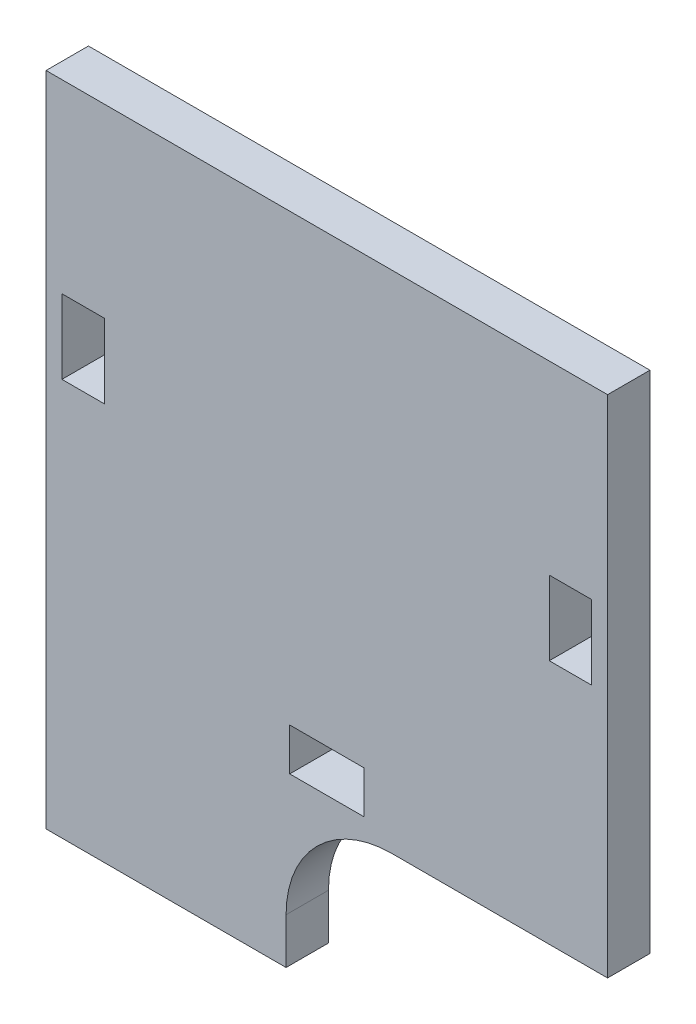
ISO-10303-21;
HEADER;
FILE_DESCRIPTION(('STEP AP214'),'2;1');
FILE_NAME('part.step','',(''),(''),'','','');
FILE_SCHEMA(('AUTOMOTIVE_DESIGN { 1 0 10303 214 1 1 1 1 }'));
ENDSEC;
DATA;
#1=APPLICATION_CONTEXT('core data for automotive mechanical design processes');
#2=APPLICATION_PROTOCOL_DEFINITION('international standard','automotive_design',2000,#1);
#3=PRODUCT_CONTEXT('',#1,'mechanical');
#4=PRODUCT('Part','Part','',(#3));
#5=PRODUCT_RELATED_PRODUCT_CATEGORY('part','',(#4));
#6=PRODUCT_DEFINITION_FORMATION('','',#4);
#7=PRODUCT_DEFINITION_CONTEXT('part definition',#1,'design');
#8=PRODUCT_DEFINITION('design','',#6,#7);
#9=PRODUCT_DEFINITION_SHAPE('','',#8);
#10=(LENGTH_UNIT() NAMED_UNIT(*) SI_UNIT(.MILLI.,.METRE.));
#11=(NAMED_UNIT(*) PLANE_ANGLE_UNIT() SI_UNIT($,.RADIAN.));
#12=(NAMED_UNIT(*) SI_UNIT($,.STERADIAN.) SOLID_ANGLE_UNIT());
#13=UNCERTAINTY_MEASURE_WITH_UNIT(LENGTH_MEASURE(1.E-05),#10,'distance_accuracy_value','');
#14=(GEOMETRIC_REPRESENTATION_CONTEXT(3) GLOBAL_UNCERTAINTY_ASSIGNED_CONTEXT((#13)) GLOBAL_UNIT_ASSIGNED_CONTEXT((#10,
#11,#12)) REPRESENTATION_CONTEXT('',''));
#15=CARTESIAN_POINT('',(0.,0.,0.));
#16=DIRECTION('',(0.,0.,1.));
#17=DIRECTION('',(1.,0.,0.));
#18=AXIS2_PLACEMENT_3D('',#15,#16,#17);
#19=CARTESIAN_POINT('',(22.4511137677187,0.,4.));
#20=DIRECTION('',(1.,0.,0.));
#21=DIRECTION('',(0.,1.,0.));
#22=AXIS2_PLACEMENT_3D('',#19,#20,#21);
#23=PLANE('',#22);
#24=DIRECTION('',(0.,0.,1.));
#25=VECTOR('',#24,1.);
#26=CARTESIAN_POINT('',(22.4511137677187,-41.0482536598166,4.));
#27=LINE('',#26,#25);
#28=CARTESIAN_POINT('',(22.4511137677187,-41.0482536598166,0.));
#29=VERTEX_POINT('',#28);
#30=CARTESIAN_POINT('',(22.4511137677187,-41.0482536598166,4.));
#31=VERTEX_POINT('',#30);
#32=EDGE_CURVE('E163',#29,#31,#27,.T.);
#33=ORIENTED_EDGE('',*,*,#32,.F.);
#34=DIRECTION('',(0.,-1.,0.));
#35=VECTOR('',#34,1.);
#36=CARTESIAN_POINT('',(22.4511137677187,0.,0.));
#37=LINE('',#36,#35);
#38=CARTESIAN_POINT('',(22.4511137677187,6.63529391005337,0.));
#39=VERTEX_POINT('',#38);
#40=EDGE_CURVE('E234',#39,#29,#37,.T.);
#41=ORIENTED_EDGE('',*,*,#40,.F.);
#42=DIRECTION('',(0.,0.,-1.));
#43=VECTOR('',#42,1.);
#44=CARTESIAN_POINT('',(22.4511137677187,6.63529391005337,4.));
#45=LINE('',#44,#43);
#46=CARTESIAN_POINT('',(22.4511137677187,6.63529391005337,4.));
#47=VERTEX_POINT('',#46);
#48=EDGE_CURVE('E181',#47,#39,#45,.T.);
#49=ORIENTED_EDGE('',*,*,#48,.F.);
#50=DIRECTION('',(0.,-1.,0.));
#51=VECTOR('',#50,1.);
#52=CARTESIAN_POINT('',(22.4511137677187,0.,4.));
#53=LINE('',#52,#51);
#54=EDGE_CURVE('E177',#47,#31,#53,.T.);
#55=ORIENTED_EDGE('',*,*,#54,.T.);
#56=EDGE_LOOP('',(#33,#41,#49,#55));
#57=FACE_BOUND('',#56,.T.);
#58=ADVANCED_FACE('F35',(#57),#23,.T.);
#59=CARTESIAN_POINT('',(0.,6.63529391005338,4.));
#60=DIRECTION('',(0.,1.,0.));
#61=DIRECTION('',(-1.,0.,0.));
#62=AXIS2_PLACEMENT_3D('',#59,#60,#61);
#63=PLANE('',#62);
#64=DIRECTION('',(1.,0.,0.));
#65=VECTOR('',#64,1.);
#66=CARTESIAN_POINT('',(0.,6.63529391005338,0.));
#67=LINE('',#66,#65);
#68=CARTESIAN_POINT('',(-30.5488862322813,6.63529391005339,0.));
#69=VERTEX_POINT('',#68);
#70=EDGE_CURVE('E236',#69,#39,#67,.T.);
#71=ORIENTED_EDGE('',*,*,#70,.F.);
#72=DIRECTION('',(0.,0.,-1.));
#73=VECTOR('',#72,1.);
#74=CARTESIAN_POINT('',(-30.5488862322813,6.63529391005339,4.));
#75=LINE('',#74,#73);
#76=CARTESIAN_POINT('',(-30.5488862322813,6.63529391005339,4.));
#77=VERTEX_POINT('',#76);
#78=EDGE_CURVE('E249',#77,#69,#75,.T.);
#79=ORIENTED_EDGE('',*,*,#78,.F.);
#80=DIRECTION('',(1.,0.,0.));
#81=VECTOR('',#80,1.);
#82=CARTESIAN_POINT('',(0.,6.63529391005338,4.));
#83=LINE('',#82,#81);
#84=EDGE_CURVE('E182',#77,#47,#83,.T.);
#85=ORIENTED_EDGE('',*,*,#84,.T.);
#86=ORIENTED_EDGE('',*,*,#48,.T.);
#87=EDGE_LOOP('',(#71,#79,#85,#86));
#88=FACE_BOUND('',#87,.T.);
#89=ADVANCED_FACE('F350',(#88),#63,.T.);
#90=CARTESIAN_POINT('',(-30.5488862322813,0.,4.));
#91=DIRECTION('',(1.,0.,0.));
#92=DIRECTION('',(0.,1.,0.));
#93=AXIS2_PLACEMENT_3D('',#90,#91,#92);
#94=PLANE('',#93);
#95=DIRECTION('',(0.,-1.,0.));
#96=VECTOR('',#95,1.);
#97=CARTESIAN_POINT('',(-30.5488862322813,0.,0.));
#98=LINE('',#97,#96);
#99=CARTESIAN_POINT('',(-30.5488862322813,-55.3647060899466,0.));
#100=VERTEX_POINT('',#99);
#101=EDGE_CURVE('E239',#69,#100,#98,.T.);
#102=ORIENTED_EDGE('',*,*,#101,.T.);
#103=DIRECTION('',(0.,0.,-1.));
#104=VECTOR('',#103,1.);
#105=CARTESIAN_POINT('',(-30.5488862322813,-55.3647060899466,4.));
#106=LINE('',#105,#104);
#107=CARTESIAN_POINT('',(-30.5488862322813,-55.3647060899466,4.));
#108=VERTEX_POINT('',#107);
#109=EDGE_CURVE('E246',#108,#100,#106,.T.);
#110=ORIENTED_EDGE('',*,*,#109,.F.);
#111=DIRECTION('',(0.,-1.,0.));
#112=VECTOR('',#111,1.);
#113=CARTESIAN_POINT('',(-30.5488862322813,0.,4.));
#114=LINE('',#113,#112);
#115=EDGE_CURVE('E185',#77,#108,#114,.T.);
#116=ORIENTED_EDGE('',*,*,#115,.F.);
#117=ORIENTED_EDGE('',*,*,#78,.T.);
#118=EDGE_LOOP('',(#102,#110,#116,#117));
#119=FACE_BOUND('',#118,.T.);
#120=ADVANCED_FACE('F355',(#119),#94,.F.);
#121=CARTESIAN_POINT('',(0.,-55.3647060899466,4.));
#122=DIRECTION('',(0.,1.,0.));
#123=DIRECTION('',(0.,0.,1.));
#124=AXIS2_PLACEMENT_3D('',#121,#122,#123);
#125=PLANE('',#124);
#126=DIRECTION('',(1.,0.,0.));
#127=VECTOR('',#126,1.);
#128=CARTESIAN_POINT('',(0.,-55.3647060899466,0.));
#129=LINE('',#128,#127);
#130=CARTESIAN_POINT('',(-7.89370636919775,-55.3647060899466,0.));
#131=VERTEX_POINT('',#130);
#132=EDGE_CURVE('E242',#100,#131,#129,.T.);
#133=ORIENTED_EDGE('',*,*,#132,.T.);
#134=DIRECTION('',(0.,0.,1.));
#135=VECTOR('',#134,1.);
#136=CARTESIAN_POINT('',(-7.89370636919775,-55.3647060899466,4.));
#137=LINE('',#136,#135);
#138=CARTESIAN_POINT('',(-7.89370636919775,-55.3647060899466,4.));
#139=VERTEX_POINT('',#138);
#140=EDGE_CURVE('E171',#131,#139,#137,.T.);
#141=ORIENTED_EDGE('',*,*,#140,.T.);
#142=DIRECTION('',(1.,0.,0.));
#143=VECTOR('',#142,1.);
#144=CARTESIAN_POINT('',(0.,-55.3647060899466,4.));
#145=LINE('',#144,#143);
#146=EDGE_CURVE('E194',#108,#139,#145,.T.);
#147=ORIENTED_EDGE('',*,*,#146,.F.);
#148=ORIENTED_EDGE('',*,*,#109,.T.);
#149=EDGE_LOOP('',(#133,#141,#147,#148));
#150=FACE_BOUND('',#149,.T.);
#151=ADVANCED_FACE('F371',(#150),#125,.F.);
#152=CARTESIAN_POINT('',(0.,-35.3647060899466,4.));
#153=DIRECTION('',(0.,1.,0.));
#154=DIRECTION('',(0.,0.,1.));
#155=AXIS2_PLACEMENT_3D('',#152,#153,#154);
#156=PLANE('',#155);
#157=DIRECTION('',(1.,0.,0.));
#158=VECTOR('',#157,1.);
#159=CARTESIAN_POINT('',(0.,-35.3647060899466,0.));
#160=LINE('',#159,#158);
#161=CARTESIAN_POINT('',(-7.54888623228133,-35.3647060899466,0.));
#162=VERTEX_POINT('',#161);
#163=CARTESIAN_POINT('',(-0.548886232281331,-35.3647060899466,0.));
#164=VERTEX_POINT('',#163);
#165=EDGE_CURVE('E222',#162,#164,#160,.T.);
#166=ORIENTED_EDGE('',*,*,#165,.T.);
#167=DIRECTION('',(0.,0.,-1.));
#168=VECTOR('',#167,1.);
#169=CARTESIAN_POINT('',(-0.548886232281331,-35.3647060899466,4.));
#170=LINE('',#169,#168);
#171=CARTESIAN_POINT('',(-0.548886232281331,-35.3647060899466,4.));
#172=VERTEX_POINT('',#171);
#173=EDGE_CURVE('E250',#172,#164,#170,.T.);
#174=ORIENTED_EDGE('',*,*,#173,.F.);
#175=DIRECTION('',(1.,0.,0.));
#176=VECTOR('',#175,1.);
#177=CARTESIAN_POINT('',(0.,-35.3647060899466,4.));
#178=LINE('',#177,#176);
#179=CARTESIAN_POINT('',(-7.54888623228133,-35.3647060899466,4.));
#180=VERTEX_POINT('',#179);
#181=EDGE_CURVE('E316',#180,#172,#178,.T.);
#182=ORIENTED_EDGE('',*,*,#181,.F.);
#183=DIRECTION('',(0.,0.,-1.));
#184=VECTOR('',#183,1.);
#185=CARTESIAN_POINT('',(-7.54888623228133,-35.3647060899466,4.));
#186=LINE('',#185,#184);
#187=EDGE_CURVE('E253',#180,#162,#186,.T.);
#188=ORIENTED_EDGE('',*,*,#187,.T.);
#189=EDGE_LOOP('',(#166,#174,#182,#188));
#190=FACE_BOUND('',#189,.T.);
#191=ADVANCED_FACE('F335',(#190),#156,.F.);
#192=CARTESIAN_POINT('',(-0.548886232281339,0.,4.));
#193=DIRECTION('',(1.,0.,0.));
#194=DIRECTION('',(0.,1.,0.));
#195=AXIS2_PLACEMENT_3D('',#192,#193,#194);
#196=PLANE('',#195);
#197=DIRECTION('',(0.,-1.,0.));
#198=VECTOR('',#197,1.);
#199=CARTESIAN_POINT('',(-0.548886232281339,0.,0.));
#200=LINE('',#199,#198);
#201=CARTESIAN_POINT('',(-0.548886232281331,-39.3647060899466,0.));
#202=VERTEX_POINT('',#201);
#203=EDGE_CURVE('E225',#164,#202,#200,.T.);
#204=ORIENTED_EDGE('',*,*,#203,.T.);
#205=DIRECTION('',(0.,0.,-1.));
#206=VECTOR('',#205,1.);
#207=CARTESIAN_POINT('',(-0.548886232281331,-39.3647060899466,4.));
#208=LINE('',#207,#206);
#209=CARTESIAN_POINT('',(-0.548886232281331,-39.3647060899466,4.));
#210=VERTEX_POINT('',#209);
#211=EDGE_CURVE('E258',#210,#202,#208,.T.);
#212=ORIENTED_EDGE('',*,*,#211,.F.);
#213=DIRECTION('',(0.,-1.,0.));
#214=VECTOR('',#213,1.);
#215=CARTESIAN_POINT('',(-0.548886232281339,0.,4.));
#216=LINE('',#215,#214);
#217=EDGE_CURVE('E319',#172,#210,#216,.T.);
#218=ORIENTED_EDGE('',*,*,#217,.F.);
#219=ORIENTED_EDGE('',*,*,#173,.T.);
#220=EDGE_LOOP('',(#204,#212,#218,#219));
#221=FACE_BOUND('',#220,.T.);
#222=ADVANCED_FACE('F337',(#221),#196,.F.);
#223=CARTESIAN_POINT('',(0.,-39.3647060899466,4.));
#224=DIRECTION('',(0.,1.,0.));
#225=DIRECTION('',(0.,0.,1.));
#226=AXIS2_PLACEMENT_3D('',#223,#224,#225);
#227=PLANE('',#226);
#228=DIRECTION('',(1.,0.,0.));
#229=VECTOR('',#228,1.);
#230=CARTESIAN_POINT('',(0.,-39.3647060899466,0.));
#231=LINE('',#230,#229);
#232=CARTESIAN_POINT('',(-7.54888623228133,-39.3647060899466,0.));
#233=VERTEX_POINT('',#232);
#234=EDGE_CURVE('E228',#233,#202,#231,.T.);
#235=ORIENTED_EDGE('',*,*,#234,.F.);
#236=DIRECTION('',(0.,0.,-1.));
#237=VECTOR('',#236,1.);
#238=CARTESIAN_POINT('',(-7.54888623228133,-39.3647060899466,4.));
#239=LINE('',#238,#237);
#240=CARTESIAN_POINT('',(-7.54888623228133,-39.3647060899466,4.));
#241=VERTEX_POINT('',#240);
#242=EDGE_CURVE('E255',#241,#233,#239,.T.);
#243=ORIENTED_EDGE('',*,*,#242,.F.);
#244=DIRECTION('',(1.,0.,0.));
#245=VECTOR('',#244,1.);
#246=CARTESIAN_POINT('',(0.,-39.3647060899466,4.));
#247=LINE('',#246,#245);
#248=EDGE_CURVE('E188',#241,#210,#247,.T.);
#249=ORIENTED_EDGE('',*,*,#248,.T.);
#250=ORIENTED_EDGE('',*,*,#211,.T.);
#251=EDGE_LOOP('',(#235,#243,#249,#250));
#252=FACE_BOUND('',#251,.T.);
#253=ADVANCED_FACE('F324',(#252),#227,.T.);
#254=CARTESIAN_POINT('',(0.,-10.8647060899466,4.));
#255=DIRECTION('',(0.,1.,0.));
#256=DIRECTION('',(0.,0.,1.));
#257=AXIS2_PLACEMENT_3D('',#254,#255,#256);
#258=PLANE('',#257);
#259=DIRECTION('',(1.,0.,0.));
#260=VECTOR('',#259,1.);
#261=CARTESIAN_POINT('',(0.,-10.8647060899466,0.));
#262=LINE('',#261,#260);
#263=CARTESIAN_POINT('',(-29.0488862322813,-10.8647060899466,0.));
#264=VERTEX_POINT('',#263);
#265=CARTESIAN_POINT('',(-25.0488862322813,-10.8647060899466,0.));
#266=VERTEX_POINT('',#265);
#267=EDGE_CURVE('E210',#264,#266,#262,.T.);
#268=ORIENTED_EDGE('',*,*,#267,.T.);
#269=DIRECTION('',(0.,0.,-1.));
#270=VECTOR('',#269,1.);
#271=CARTESIAN_POINT('',(-25.0488862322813,-10.8647060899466,4.));
#272=LINE('',#271,#270);
#273=CARTESIAN_POINT('',(-25.0488862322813,-10.8647060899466,4.));
#274=VERTEX_POINT('',#273);
#275=EDGE_CURVE('E256',#274,#266,#272,.T.);
#276=ORIENTED_EDGE('',*,*,#275,.F.);
#277=DIRECTION('',(1.,0.,0.));
#278=VECTOR('',#277,1.);
#279=CARTESIAN_POINT('',(0.,-10.8647060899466,4.));
#280=LINE('',#279,#278);
#281=CARTESIAN_POINT('',(-29.0488862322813,-10.8647060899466,4.));
#282=VERTEX_POINT('',#281);
#283=EDGE_CURVE('E305',#282,#274,#280,.T.);
#284=ORIENTED_EDGE('',*,*,#283,.F.);
#285=DIRECTION('',(0.,0.,-1.));
#286=VECTOR('',#285,1.);
#287=CARTESIAN_POINT('',(-29.0488862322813,-10.8647060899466,4.));
#288=LINE('',#287,#286);
#289=EDGE_CURVE('E262',#282,#264,#288,.T.);
#290=ORIENTED_EDGE('',*,*,#289,.T.);
#291=EDGE_LOOP('',(#268,#276,#284,#290));
#292=FACE_BOUND('',#291,.T.);
#293=ADVANCED_FACE('F366',(#292),#258,.F.);
#294=CARTESIAN_POINT('',(-25.0488862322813,0.,4.));
#295=DIRECTION('',(1.,0.,0.));
#296=DIRECTION('',(0.,0.,-1.));
#297=AXIS2_PLACEMENT_3D('',#294,#295,#296);
#298=PLANE('',#297);
#299=DIRECTION('',(0.,-1.,0.));
#300=VECTOR('',#299,1.);
#301=CARTESIAN_POINT('',(-25.0488862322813,0.,0.));
#302=LINE('',#301,#300);
#303=CARTESIAN_POINT('',(-25.0488862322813,-17.8647060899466,0.));
#304=VERTEX_POINT('',#303);
#305=EDGE_CURVE('E213',#266,#304,#302,.T.);
#306=ORIENTED_EDGE('',*,*,#305,.T.);
#307=DIRECTION('',(0.,0.,-1.));
#308=VECTOR('',#307,1.);
#309=CARTESIAN_POINT('',(-25.0488862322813,-17.8647060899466,4.));
#310=LINE('',#309,#308);
#311=CARTESIAN_POINT('',(-25.0488862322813,-17.8647060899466,4.));
#312=VERTEX_POINT('',#311);
#313=EDGE_CURVE('E267',#312,#304,#310,.T.);
#314=ORIENTED_EDGE('',*,*,#313,.F.);
#315=DIRECTION('',(0.,-1.,0.));
#316=VECTOR('',#315,1.);
#317=CARTESIAN_POINT('',(-25.0488862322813,0.,4.));
#318=LINE('',#317,#316);
#319=EDGE_CURVE('E308',#274,#312,#318,.T.);
#320=ORIENTED_EDGE('',*,*,#319,.F.);
#321=ORIENTED_EDGE('',*,*,#275,.T.);
#322=EDGE_LOOP('',(#306,#314,#320,#321));
#323=FACE_BOUND('',#322,.T.);
#324=ADVANCED_FACE('F380',(#323),#298,.F.);
#325=CARTESIAN_POINT('',(0.,-17.8647060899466,4.));
#326=DIRECTION('',(0.,1.,0.));
#327=DIRECTION('',(0.,0.,1.));
#328=AXIS2_PLACEMENT_3D('',#325,#326,#327);
#329=PLANE('',#328);
#330=DIRECTION('',(1.,0.,0.));
#331=VECTOR('',#330,1.);
#332=CARTESIAN_POINT('',(0.,-17.8647060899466,0.));
#333=LINE('',#332,#331);
#334=CARTESIAN_POINT('',(-29.0488862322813,-17.8647060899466,0.));
#335=VERTEX_POINT('',#334);
#336=EDGE_CURVE('E216',#335,#304,#333,.T.);
#337=ORIENTED_EDGE('',*,*,#336,.F.);
#338=DIRECTION('',(0.,0.,-1.));
#339=VECTOR('',#338,1.);
#340=CARTESIAN_POINT('',(-29.0488862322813,-17.8647060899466,4.));
#341=LINE('',#340,#339);
#342=CARTESIAN_POINT('',(-29.0488862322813,-17.8647060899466,4.));
#343=VERTEX_POINT('',#342);
#344=EDGE_CURVE('E264',#343,#335,#341,.T.);
#345=ORIENTED_EDGE('',*,*,#344,.F.);
#346=DIRECTION('',(1.,0.,0.));
#347=VECTOR('',#346,1.);
#348=CARTESIAN_POINT('',(0.,-17.8647060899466,4.));
#349=LINE('',#348,#347);
#350=EDGE_CURVE('E310',#343,#312,#349,.T.);
#351=ORIENTED_EDGE('',*,*,#350,.T.);
#352=ORIENTED_EDGE('',*,*,#313,.T.);
#353=EDGE_LOOP('',(#337,#345,#351,#352));
#354=FACE_BOUND('',#353,.T.);
#355=ADVANCED_FACE('F376',(#354),#329,.T.);
#356=CARTESIAN_POINT('',(0.,-10.8647060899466,4.));
#357=DIRECTION('',(0.,1.,0.));
#358=DIRECTION('',(0.,0.,1.));
#359=AXIS2_PLACEMENT_3D('',#356,#357,#358);
#360=PLANE('',#359);
#361=DIRECTION('',(1.,0.,0.));
#362=VECTOR('',#361,1.);
#363=CARTESIAN_POINT('',(0.,-10.8647060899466,0.));
#364=LINE('',#363,#362);
#365=CARTESIAN_POINT('',(16.9511137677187,-10.8647060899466,0.));
#366=VERTEX_POINT('',#365);
#367=CARTESIAN_POINT('',(20.9511137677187,-10.8647060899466,0.));
#368=VERTEX_POINT('',#367);
#369=EDGE_CURVE('E198',#366,#368,#364,.T.);
#370=ORIENTED_EDGE('',*,*,#369,.T.);
#371=DIRECTION('',(0.,0.,-1.));
#372=VECTOR('',#371,1.);
#373=CARTESIAN_POINT('',(20.9511137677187,-10.8647060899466,4.));
#374=LINE('',#373,#372);
#375=CARTESIAN_POINT('',(20.9511137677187,-10.8647060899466,4.));
#376=VERTEX_POINT('',#375);
#377=EDGE_CURVE('E265',#376,#368,#374,.T.);
#378=ORIENTED_EDGE('',*,*,#377,.F.);
#379=DIRECTION('',(1.,0.,0.));
#380=VECTOR('',#379,1.);
#381=CARTESIAN_POINT('',(0.,-10.8647060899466,4.));
#382=LINE('',#381,#380);
#383=CARTESIAN_POINT('',(16.9511137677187,-10.8647060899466,4.));
#384=VERTEX_POINT('',#383);
#385=EDGE_CURVE('E245',#384,#376,#382,.T.);
#386=ORIENTED_EDGE('',*,*,#385,.F.);
#387=DIRECTION('',(0.,0.,-1.));
#388=VECTOR('',#387,1.);
#389=CARTESIAN_POINT('',(16.9511137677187,-10.8647060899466,4.));
#390=LINE('',#389,#388);
#391=EDGE_CURVE('E197',#384,#366,#390,.T.);
#392=ORIENTED_EDGE('',*,*,#391,.T.);
#393=EDGE_LOOP('',(#370,#378,#386,#392));
#394=FACE_BOUND('',#393,.T.);
#395=ADVANCED_FACE('F379',(#394),#360,.F.);
#396=CARTESIAN_POINT('',(20.9511137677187,0.,4.));
#397=DIRECTION('',(1.,0.,0.));
#398=DIRECTION('',(0.,0.,-1.));
#399=AXIS2_PLACEMENT_3D('',#396,#397,#398);
#400=PLANE('',#399);
#401=DIRECTION('',(0.,-1.,0.));
#402=VECTOR('',#401,1.);
#403=CARTESIAN_POINT('',(20.9511137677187,0.,0.));
#404=LINE('',#403,#402);
#405=CARTESIAN_POINT('',(20.9511137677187,-17.8647060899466,0.));
#406=VERTEX_POINT('',#405);
#407=EDGE_CURVE('E201',#368,#406,#404,.T.);
#408=ORIENTED_EDGE('',*,*,#407,.T.);
#409=DIRECTION('',(0.,0.,-1.));
#410=VECTOR('',#409,1.);
#411=CARTESIAN_POINT('',(20.9511137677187,-17.8647060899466,4.));
#412=LINE('',#411,#410);
#413=CARTESIAN_POINT('',(20.9511137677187,-17.8647060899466,4.));
#414=VERTEX_POINT('',#413);
#415=EDGE_CURVE('E274',#414,#406,#412,.T.);
#416=ORIENTED_EDGE('',*,*,#415,.F.);
#417=DIRECTION('',(0.,-1.,0.));
#418=VECTOR('',#417,1.);
#419=CARTESIAN_POINT('',(20.9511137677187,0.,4.));
#420=LINE('',#419,#418);
#421=EDGE_CURVE('E297',#376,#414,#420,.T.);
#422=ORIENTED_EDGE('',*,*,#421,.F.);
#423=ORIENTED_EDGE('',*,*,#377,.T.);
#424=EDGE_LOOP('',(#408,#416,#422,#423));
#425=FACE_BOUND('',#424,.T.);
#426=ADVANCED_FACE('F393',(#425),#400,.F.);
#427=CARTESIAN_POINT('',(0.,-17.8647060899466,4.));
#428=DIRECTION('',(0.,1.,0.));
#429=DIRECTION('',(0.,0.,1.));
#430=AXIS2_PLACEMENT_3D('',#427,#428,#429);
#431=PLANE('',#430);
#432=DIRECTION('',(1.,0.,0.));
#433=VECTOR('',#432,1.);
#434=CARTESIAN_POINT('',(0.,-17.8647060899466,0.));
#435=LINE('',#434,#433);
#436=CARTESIAN_POINT('',(16.9511137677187,-17.8647060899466,0.));
#437=VERTEX_POINT('',#436);
#438=EDGE_CURVE('E204',#437,#406,#435,.T.);
#439=ORIENTED_EDGE('',*,*,#438,.F.);
#440=DIRECTION('',(0.,0.,-1.));
#441=VECTOR('',#440,1.);
#442=CARTESIAN_POINT('',(16.9511137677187,-17.8647060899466,4.));
#443=LINE('',#442,#441);
#444=CARTESIAN_POINT('',(16.9511137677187,-17.8647060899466,4.));
#445=VERTEX_POINT('',#444);
#446=EDGE_CURVE('E272',#445,#437,#443,.T.);
#447=ORIENTED_EDGE('',*,*,#446,.F.);
#448=DIRECTION('',(1.,0.,0.));
#449=VECTOR('',#448,1.);
#450=CARTESIAN_POINT('',(0.,-17.8647060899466,4.));
#451=LINE('',#450,#449);
#452=EDGE_CURVE('E299',#445,#414,#451,.T.);
#453=ORIENTED_EDGE('',*,*,#452,.T.);
#454=ORIENTED_EDGE('',*,*,#415,.T.);
#455=EDGE_LOOP('',(#439,#447,#453,#454));
#456=FACE_BOUND('',#455,.T.);
#457=ADVANCED_FACE('F363',(#456),#431,.T.);
#458=CARTESIAN_POINT('',(-7.54888623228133,0.,4.));
#459=DIRECTION('',(1.,0.,0.));
#460=DIRECTION('',(0.,0.,-1.));
#461=AXIS2_PLACEMENT_3D('',#458,#459,#460);
#462=PLANE('',#461);
#463=DIRECTION('',(0.,-1.,0.));
#464=VECTOR('',#463,1.);
#465=CARTESIAN_POINT('',(-7.54888623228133,0.,0.));
#466=LINE('',#465,#464);
#467=EDGE_CURVE('E231',#162,#233,#466,.T.);
#468=ORIENTED_EDGE('',*,*,#467,.F.);
#469=ORIENTED_EDGE('',*,*,#187,.F.);
#470=DIRECTION('',(0.,-1.,0.));
#471=VECTOR('',#470,1.);
#472=CARTESIAN_POINT('',(-7.54888623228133,0.,4.));
#473=LINE('',#472,#471);
#474=EDGE_CURVE('E183',#180,#241,#473,.T.);
#475=ORIENTED_EDGE('',*,*,#474,.T.);
#476=ORIENTED_EDGE('',*,*,#242,.T.);
#477=EDGE_LOOP('',(#468,#469,#475,#476));
#478=FACE_BOUND('',#477,.T.);
#479=ADVANCED_FACE('F330',(#478),#462,.T.);
#480=CARTESIAN_POINT('',(-29.0488862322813,0.,4.));
#481=DIRECTION('',(1.,0.,0.));
#482=DIRECTION('',(0.,0.,-1.));
#483=AXIS2_PLACEMENT_3D('',#480,#481,#482);
#484=PLANE('',#483);
#485=DIRECTION('',(0.,-1.,0.));
#486=VECTOR('',#485,1.);
#487=CARTESIAN_POINT('',(-29.0488862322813,0.,0.));
#488=LINE('',#487,#486);
#489=EDGE_CURVE('E219',#264,#335,#488,.T.);
#490=ORIENTED_EDGE('',*,*,#489,.F.);
#491=ORIENTED_EDGE('',*,*,#289,.F.);
#492=DIRECTION('',(0.,-1.,0.));
#493=VECTOR('',#492,1.);
#494=CARTESIAN_POINT('',(-29.0488862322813,0.,4.));
#495=LINE('',#494,#493);
#496=EDGE_CURVE('E313',#282,#343,#495,.T.);
#497=ORIENTED_EDGE('',*,*,#496,.T.);
#498=ORIENTED_EDGE('',*,*,#344,.T.);
#499=EDGE_LOOP('',(#490,#491,#497,#498));
#500=FACE_BOUND('',#499,.T.);
#501=ADVANCED_FACE('F362',(#500),#484,.T.);
#502=CARTESIAN_POINT('',(16.9511137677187,0.,4.));
#503=DIRECTION('',(1.,0.,0.));
#504=DIRECTION('',(0.,0.,-1.));
#505=AXIS2_PLACEMENT_3D('',#502,#503,#504);
#506=PLANE('',#505);
#507=DIRECTION('',(0.,-1.,0.));
#508=VECTOR('',#507,1.);
#509=CARTESIAN_POINT('',(16.9511137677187,0.,0.));
#510=LINE('',#509,#508);
#511=EDGE_CURVE('E207',#366,#437,#510,.T.);
#512=ORIENTED_EDGE('',*,*,#511,.F.);
#513=ORIENTED_EDGE('',*,*,#391,.F.);
#514=DIRECTION('',(0.,-1.,0.));
#515=VECTOR('',#514,1.);
#516=CARTESIAN_POINT('',(16.9511137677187,0.,4.));
#517=LINE('',#516,#515);
#518=EDGE_CURVE('E302',#384,#445,#517,.T.);
#519=ORIENTED_EDGE('',*,*,#518,.T.);
#520=ORIENTED_EDGE('',*,*,#446,.T.);
#521=EDGE_LOOP('',(#512,#513,#519,#520));
#522=FACE_BOUND('',#521,.T.);
#523=ADVANCED_FACE('F374',(#522),#506,.T.);
#524=CARTESIAN_POINT('',(0.,0.,4.));
#525=DIRECTION('',(0.,0.,1.));
#526=DIRECTION('',(1.,0.,0.));
#527=AXIS2_PLACEMENT_3D('',#524,#525,#526);
#528=PLANE('',#527);
#529=DIRECTION('',(0.,-1.,0.));
#530=VECTOR('',#529,1.);
#531=CARTESIAN_POINT('',(-7.89370636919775,-41.0482536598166,4.));
#532=LINE('',#531,#530);
#533=CARTESIAN_POINT('',(-7.89370636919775,-51.0482536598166,4.));
#534=VERTEX_POINT('',#533);
#535=EDGE_CURVE('E179',#534,#139,#532,.T.);
#536=ORIENTED_EDGE('',*,*,#535,.F.);
#537=CARTESIAN_POINT('',(2.10629363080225,-51.0482536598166,4.));
#538=DIRECTION('',(0.,0.,1.));
#539=DIRECTION('',(1.,0.,0.));
#540=AXIS2_PLACEMENT_3D('',#537,#538,#539);
#541=CIRCLE('',#540,10.);
#542=CARTESIAN_POINT('',(2.10629363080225,-41.0482536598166,4.));
#543=VERTEX_POINT('',#542);
#544=EDGE_CURVE('E43',#534,#543,#541,.F.);
#545=ORIENTED_EDGE('',*,*,#544,.T.);
#546=DIRECTION('',(-1.,0.,0.));
#547=VECTOR('',#546,1.);
#548=CARTESIAN_POINT('',(-7.89370636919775,-41.0482536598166,4.));
#549=LINE('',#548,#547);
#550=EDGE_CURVE('E165',#31,#543,#549,.T.);
#551=ORIENTED_EDGE('',*,*,#550,.F.);
#552=ORIENTED_EDGE('',*,*,#54,.F.);
#553=ORIENTED_EDGE('',*,*,#84,.F.);
#554=ORIENTED_EDGE('',*,*,#115,.T.);
#555=ORIENTED_EDGE('',*,*,#146,.T.);
#556=EDGE_LOOP('',(#536,#545,#551,#552,#553,#554,#555));
#557=FACE_BOUND('',#556,.T.);
#558=ORIENTED_EDGE('',*,*,#385,.T.);
#559=ORIENTED_EDGE('',*,*,#421,.T.);
#560=ORIENTED_EDGE('',*,*,#452,.F.);
#561=ORIENTED_EDGE('',*,*,#518,.F.);
#562=EDGE_LOOP('',(#558,#559,#560,#561));
#563=FACE_BOUND('',#562,.T.);
#564=ORIENTED_EDGE('',*,*,#283,.T.);
#565=ORIENTED_EDGE('',*,*,#319,.T.);
#566=ORIENTED_EDGE('',*,*,#350,.F.);
#567=ORIENTED_EDGE('',*,*,#496,.F.);
#568=EDGE_LOOP('',(#564,#565,#566,#567));
#569=FACE_BOUND('',#568,.T.);
#570=ORIENTED_EDGE('',*,*,#181,.T.);
#571=ORIENTED_EDGE('',*,*,#217,.T.);
#572=ORIENTED_EDGE('',*,*,#248,.F.);
#573=ORIENTED_EDGE('',*,*,#474,.F.);
#574=EDGE_LOOP('',(#570,#571,#572,#573));
#575=FACE_BOUND('',#574,.T.);
#576=ADVANCED_FACE('F174',(#557,#563,#569,#575),#528,.T.);
#577=CARTESIAN_POINT('',(0.,0.,0.));
#578=DIRECTION('',(0.,0.,1.));
#579=DIRECTION('',(1.,0.,0.));
#580=AXIS2_PLACEMENT_3D('',#577,#578,#579);
#581=PLANE('',#580);
#582=ORIENTED_EDGE('',*,*,#369,.F.);
#583=ORIENTED_EDGE('',*,*,#511,.T.);
#584=ORIENTED_EDGE('',*,*,#438,.T.);
#585=ORIENTED_EDGE('',*,*,#407,.F.);
#586=EDGE_LOOP('',(#582,#583,#584,#585));
#587=FACE_BOUND('',#586,.T.);
#588=ORIENTED_EDGE('',*,*,#267,.F.);
#589=ORIENTED_EDGE('',*,*,#489,.T.);
#590=ORIENTED_EDGE('',*,*,#336,.T.);
#591=ORIENTED_EDGE('',*,*,#305,.F.);
#592=EDGE_LOOP('',(#588,#589,#590,#591));
#593=FACE_BOUND('',#592,.T.);
#594=ORIENTED_EDGE('',*,*,#165,.F.);
#595=ORIENTED_EDGE('',*,*,#467,.T.);
#596=ORIENTED_EDGE('',*,*,#234,.T.);
#597=ORIENTED_EDGE('',*,*,#203,.F.);
#598=EDGE_LOOP('',(#594,#595,#596,#597));
#599=FACE_BOUND('',#598,.T.);
#600=DIRECTION('',(-1.,0.,0.));
#601=VECTOR('',#600,1.);
#602=CARTESIAN_POINT('',(0.,-41.0482536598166,0.));
#603=LINE('',#602,#601);
#604=CARTESIAN_POINT('',(2.10629363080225,-41.0482536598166,0.));
#605=VERTEX_POINT('',#604);
#606=EDGE_CURVE('E166',#29,#605,#603,.T.);
#607=ORIENTED_EDGE('',*,*,#606,.T.);
#608=CARTESIAN_POINT('',(2.10629363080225,-51.0482536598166,0.));
#609=DIRECTION('',(0.,0.,1.));
#610=DIRECTION('',(1.,0.,0.));
#611=AXIS2_PLACEMENT_3D('',#608,#609,#610);
#612=CIRCLE('',#611,10.);
#613=CARTESIAN_POINT('',(-7.89370636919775,-51.0482536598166,0.));
#614=VERTEX_POINT('',#613);
#615=EDGE_CURVE('E11',#605,#614,#612,.T.);
#616=ORIENTED_EDGE('',*,*,#615,.T.);
#617=DIRECTION('',(0.,-1.,0.));
#618=VECTOR('',#617,1.);
#619=CARTESIAN_POINT('',(-7.89370636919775,0.,0.));
#620=LINE('',#619,#618);
#621=EDGE_CURVE('E279',#614,#131,#620,.T.);
#622=ORIENTED_EDGE('',*,*,#621,.T.);
#623=ORIENTED_EDGE('',*,*,#132,.F.);
#624=ORIENTED_EDGE('',*,*,#101,.F.);
#625=ORIENTED_EDGE('',*,*,#70,.T.);
#626=ORIENTED_EDGE('',*,*,#40,.T.);
#627=EDGE_LOOP('',(#607,#616,#622,#623,#624,#625,#626));
#628=FACE_BOUND('',#627,.T.);
#629=ADVANCED_FACE('F339',(#587,#593,#599,#628),#581,.F.);
#630=CARTESIAN_POINT('',(-7.89370636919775,-41.0482536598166,-6.));
#631=DIRECTION('',(-1.,0.,0.));
#632=DIRECTION('',(0.,0.,1.));
#633=AXIS2_PLACEMENT_3D('',#630,#631,#632);
#634=PLANE('',#633);
#635=ORIENTED_EDGE('',*,*,#621,.F.);
#636=DIRECTION('',(0.,0.,1.));
#637=VECTOR('',#636,1.);
#638=CARTESIAN_POINT('',(-7.89370636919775,-51.0482536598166,4.));
#639=LINE('',#638,#637);
#640=EDGE_CURVE('E281',#614,#534,#639,.T.);
#641=ORIENTED_EDGE('',*,*,#640,.T.);
#642=ORIENTED_EDGE('',*,*,#535,.T.);
#643=ORIENTED_EDGE('',*,*,#140,.F.);
#644=EDGE_LOOP('',(#635,#641,#642,#643));
#645=FACE_BOUND('',#644,.T.);
#646=ADVANCED_FACE('F287',(#645),#634,.F.);
#647=CARTESIAN_POINT('',(-7.89370636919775,-41.0482536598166,-6.));
#648=DIRECTION('',(0.,1.,0.));
#649=DIRECTION('',(0.,0.,1.));
#650=AXIS2_PLACEMENT_3D('',#647,#648,#649);
#651=PLANE('',#650);
#652=ORIENTED_EDGE('',*,*,#550,.T.);
#653=DIRECTION('',(0.,0.,1.));
#654=VECTOR('',#653,1.);
#655=CARTESIAN_POINT('',(2.10629363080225,-41.0482536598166,0.));
#656=LINE('',#655,#654);
#657=EDGE_CURVE('E50',#543,#605,#656,.F.);
#658=ORIENTED_EDGE('',*,*,#657,.T.);
#659=ORIENTED_EDGE('',*,*,#606,.F.);
#660=ORIENTED_EDGE('',*,*,#32,.T.);
#661=EDGE_LOOP('',(#652,#658,#659,#660));
#662=FACE_BOUND('',#661,.T.);
#663=ADVANCED_FACE('F164',(#662),#651,.F.);
#664=CARTESIAN_POINT('',(2.10629363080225,-51.0482536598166,-6.));
#665=DIRECTION('',(0.,0.,-1.));
#666=DIRECTION('',(-1.,0.,0.));
#667=AXIS2_PLACEMENT_3D('',#664,#665,#666);
#668=CYLINDRICAL_SURFACE('',#667,10.);
#669=ORIENTED_EDGE('',*,*,#615,.F.);
#670=ORIENTED_EDGE('',*,*,#657,.F.);
#671=ORIENTED_EDGE('',*,*,#544,.F.);
#672=ORIENTED_EDGE('',*,*,#640,.F.);
#673=EDGE_LOOP('',(#669,#670,#671,#672));
#674=FACE_BOUND('',#673,.T.);
#675=ADVANCED_FACE('F37',(#674),#668,.F.);
#676=CLOSED_SHELL('',(#58,#89,#120,#151,#191,#222,#253,#293,#324,#355,#395,#426,#457,#479,#501,
#523,#576,#629,#646,#663,#675));
#677=MANIFOLD_SOLID_BREP('B2',#676);
#678=ADVANCED_BREP_SHAPE_REPRESENTATION('',(#18,#677),#14);
#679=SHAPE_DEFINITION_REPRESENTATION(#9,#678);
ENDSEC;
END-ISO-10303-21;
